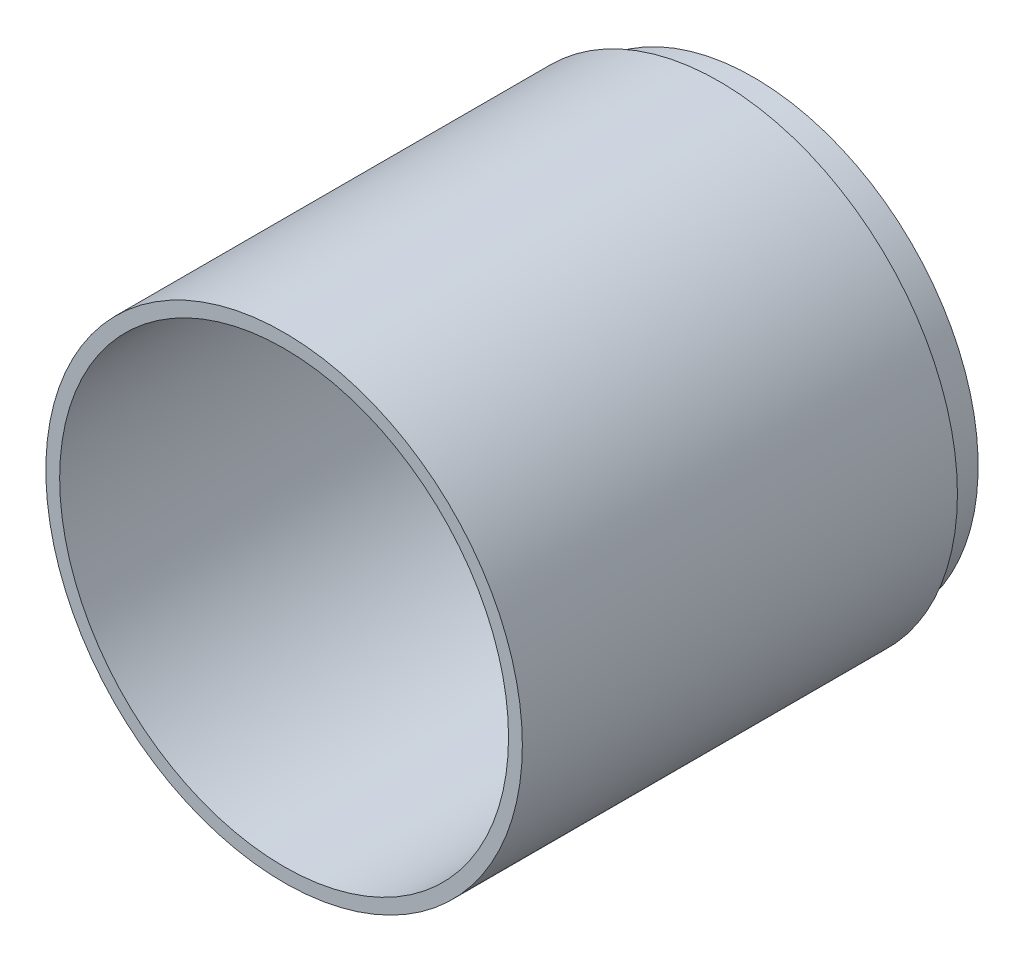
ISO-10303-21;
HEADER;
FILE_DESCRIPTION(('STEP AP214'),'2;1');
FILE_NAME('part.step','',(''),(''),'','','');
FILE_SCHEMA(('AUTOMOTIVE_DESIGN { 1 0 10303 214 1 1 1 1 }'));
ENDSEC;
DATA;
#1=APPLICATION_CONTEXT('core data for automotive mechanical design processes');
#2=APPLICATION_PROTOCOL_DEFINITION('international standard','automotive_design',2000,#1);
#3=PRODUCT_CONTEXT('',#1,'mechanical');
#4=PRODUCT('Part','Part','',(#3));
#5=PRODUCT_RELATED_PRODUCT_CATEGORY('part','',(#4));
#6=PRODUCT_DEFINITION_FORMATION('','',#4);
#7=PRODUCT_DEFINITION_CONTEXT('part definition',#1,'design');
#8=PRODUCT_DEFINITION('design','',#6,#7);
#9=PRODUCT_DEFINITION_SHAPE('','',#8);
#10=(LENGTH_UNIT() NAMED_UNIT(*) SI_UNIT(.MILLI.,.METRE.));
#11=(NAMED_UNIT(*) PLANE_ANGLE_UNIT() SI_UNIT($,.RADIAN.));
#12=(NAMED_UNIT(*) SI_UNIT($,.STERADIAN.) SOLID_ANGLE_UNIT());
#13=UNCERTAINTY_MEASURE_WITH_UNIT(LENGTH_MEASURE(1.E-05),#10,'distance_accuracy_value','');
#14=(GEOMETRIC_REPRESENTATION_CONTEXT(3) GLOBAL_UNCERTAINTY_ASSIGNED_CONTEXT((#13)) GLOBAL_UNIT_ASSIGNED_CONTEXT((#10,
#11,#12)) REPRESENTATION_CONTEXT('',''));
#15=CARTESIAN_POINT('',(0.,0.,0.));
#16=DIRECTION('',(0.,0.,1.));
#17=DIRECTION('',(1.,0.,0.));
#18=AXIS2_PLACEMENT_3D('',#15,#16,#17);
#19=CARTESIAN_POINT('',(0.,0.,63.));
#20=DIRECTION('',(0.,0.,-1.));
#21=DIRECTION('',(-1.,0.,0.));
#22=AXIS2_PLACEMENT_3D('',#19,#20,#21);
#23=CYLINDRICAL_SURFACE('',#22,32.5);
#24=CARTESIAN_POINT('',(0.,0.,63.));
#25=DIRECTION('',(0.,0.,1.));
#26=DIRECTION('',(1.,0.,0.));
#27=AXIS2_PLACEMENT_3D('',#24,#25,#26);
#28=CIRCLE('',#27,32.5);
#29=CARTESIAN_POINT('',(32.5,0.,63.));
#30=VERTEX_POINT('',#29);
#31=EDGE_CURVE('E56',#30,#30,#28,.T.);
#32=ORIENTED_EDGE('',*,*,#31,.T.);
#33=EDGE_LOOP('',(#32));
#34=FACE_BOUND('',#33,.T.);
#35=CARTESIAN_POINT('',(0.,0.,3.));
#36=DIRECTION('',(0.,0.,-1.));
#37=DIRECTION('',(-1.,0.,0.));
#38=AXIS2_PLACEMENT_3D('',#35,#36,#37);
#39=CIRCLE('',#38,32.5);
#40=CARTESIAN_POINT('',(-32.5,0.,3.));
#41=VERTEX_POINT('',#40);
#42=EDGE_CURVE('E65',#41,#41,#39,.T.);
#43=ORIENTED_EDGE('',*,*,#42,.T.);
#44=EDGE_LOOP('',(#43));
#45=FACE_BOUND('',#44,.T.);
#46=ADVANCED_FACE('F43',(#34,#45),#23,.F.);
#47=CARTESIAN_POINT('',(0.,0.,63.));
#48=DIRECTION('',(0.,0.,1.));
#49=DIRECTION('',(1.,0.,0.));
#50=AXIS2_PLACEMENT_3D('',#47,#48,#49);
#51=PLANE('',#50);
#52=CARTESIAN_POINT('',(0.,0.,63.));
#53=DIRECTION('',(0.,0.,1.));
#54=DIRECTION('',(1.,0.,0.));
#55=AXIS2_PLACEMENT_3D('',#52,#53,#54);
#56=CIRCLE('',#55,34.5);
#57=CARTESIAN_POINT('',(34.5,0.,63.));
#58=VERTEX_POINT('',#57);
#59=EDGE_CURVE('E10',#58,#58,#56,.T.);
#60=ORIENTED_EDGE('',*,*,#59,.T.);
#61=EDGE_LOOP('',(#60));
#62=FACE_BOUND('',#61,.T.);
#63=ORIENTED_EDGE('',*,*,#31,.F.);
#64=EDGE_LOOP('',(#63));
#65=FACE_BOUND('',#64,.T.);
#66=ADVANCED_FACE('F95',(#62,#65),#51,.T.);
#67=CARTESIAN_POINT('',(0.,0.,0.));
#68=DIRECTION('',(0.,0.,1.));
#69=DIRECTION('',(1.,0.,0.));
#70=AXIS2_PLACEMENT_3D('',#67,#68,#69);
#71=PLANE('',#70);
#72=CARTESIAN_POINT('',(0.,0.,0.));
#73=DIRECTION('',(0.,0.,1.));
#74=DIRECTION('',(1.,0.,0.));
#75=AXIS2_PLACEMENT_3D('',#72,#73,#74);
#76=CIRCLE('',#75,34.5);
#77=CARTESIAN_POINT('',(34.5,0.,0.));
#78=VERTEX_POINT('',#77);
#79=EDGE_CURVE('E47',#78,#78,#76,.T.);
#80=ORIENTED_EDGE('',*,*,#79,.F.);
#81=EDGE_LOOP('',(#80));
#82=FACE_BOUND('',#81,.T.);
#83=CARTESIAN_POINT('',(0.,0.,0.));
#84=DIRECTION('',(0.,0.,1.));
#85=DIRECTION('',(1.,0.,0.));
#86=AXIS2_PLACEMENT_3D('',#83,#84,#85);
#87=CIRCLE('',#86,32.5);
#88=CARTESIAN_POINT('',(32.5,0.,0.));
#89=VERTEX_POINT('',#88);
#90=EDGE_CURVE('E61',#89,#89,#87,.T.);
#91=ORIENTED_EDGE('',*,*,#90,.T.);
#92=EDGE_LOOP('',(#91));
#93=FACE_BOUND('',#92,.T.);
#94=ADVANCED_FACE('F101',(#82,#93),#71,.F.);
#95=CARTESIAN_POINT('',(0.,0.,63.));
#96=DIRECTION('',(0.,0.,-1.));
#97=DIRECTION('',(-1.,0.,0.));
#98=AXIS2_PLACEMENT_3D('',#95,#96,#97);
#99=CYLINDRICAL_SURFACE('',#98,34.5);
#100=ORIENTED_EDGE('',*,*,#59,.F.);
#101=EDGE_LOOP('',(#100));
#102=FACE_BOUND('',#101,.T.);
#103=ORIENTED_EDGE('',*,*,#79,.T.);
#104=EDGE_LOOP('',(#103));
#105=FACE_BOUND('',#104,.T.);
#106=ADVANCED_FACE('F45',(#102,#105),#99,.T.);
#107=CARTESIAN_POINT('',(0.,0.,3.));
#108=DIRECTION('',(0.,0.,-1.));
#109=DIRECTION('',(-1.,0.,0.));
#110=AXIS2_PLACEMENT_3D('',#107,#108,#109);
#111=CYLINDRICAL_SURFACE('',#110,32.5);
#112=CARTESIAN_POINT('',(0.,0.,-5.));
#113=DIRECTION('',(0.,0.,-1.));
#114=DIRECTION('',(-1.,0.,0.));
#115=AXIS2_PLACEMENT_3D('',#112,#113,#114);
#116=CIRCLE('',#115,32.5);
#117=CARTESIAN_POINT('',(-32.5,0.,-5.));
#118=VERTEX_POINT('',#117);
#119=EDGE_CURVE('E73',#118,#118,#116,.T.);
#120=ORIENTED_EDGE('',*,*,#119,.F.);
#121=EDGE_LOOP('',(#120));
#122=FACE_BOUND('',#121,.T.);
#123=ORIENTED_EDGE('',*,*,#90,.F.);
#124=EDGE_LOOP('',(#123));
#125=FACE_BOUND('',#124,.T.);
#126=ADVANCED_FACE('F105',(#122,#125),#111,.T.);
#127=CARTESIAN_POINT('',(0.,0.,3.));
#128=DIRECTION('',(0.,0.,-1.));
#129=DIRECTION('',(-1.,0.,0.));
#130=AXIS2_PLACEMENT_3D('',#127,#128,#129);
#131=PLANE('',#130);
#132=CARTESIAN_POINT('',(0.,0.,3.));
#133=DIRECTION('',(0.,0.,-1.));
#134=DIRECTION('',(-1.,0.,0.));
#135=AXIS2_PLACEMENT_3D('',#132,#133,#134);
#136=CIRCLE('',#135,30.5);
#137=CARTESIAN_POINT('',(-30.5,0.,3.));
#138=VERTEX_POINT('',#137);
#139=EDGE_CURVE('E69',#138,#138,#136,.T.);
#140=ORIENTED_EDGE('',*,*,#139,.T.);
#141=EDGE_LOOP('',(#140));
#142=FACE_BOUND('',#141,.T.);
#143=ORIENTED_EDGE('',*,*,#42,.F.);
#144=EDGE_LOOP('',(#143));
#145=FACE_BOUND('',#144,.T.);
#146=ADVANCED_FACE('F91',(#142,#145),#131,.F.);
#147=CARTESIAN_POINT('',(0.,0.,3.));
#148=DIRECTION('',(0.,0.,-1.));
#149=DIRECTION('',(-1.,0.,0.));
#150=AXIS2_PLACEMENT_3D('',#147,#148,#149);
#151=CYLINDRICAL_SURFACE('',#150,30.5);
#152=ORIENTED_EDGE('',*,*,#139,.F.);
#153=EDGE_LOOP('',(#152));
#154=FACE_BOUND('',#153,.T.);
#155=CARTESIAN_POINT('',(0.,0.,-5.));
#156=DIRECTION('',(0.,0.,-1.));
#157=DIRECTION('',(-1.,0.,0.));
#158=AXIS2_PLACEMENT_3D('',#155,#156,#157);
#159=CIRCLE('',#158,30.5);
#160=CARTESIAN_POINT('',(-30.5,0.,-5.));
#161=VERTEX_POINT('',#160);
#162=EDGE_CURVE('E77',#161,#161,#159,.T.);
#163=ORIENTED_EDGE('',*,*,#162,.T.);
#164=EDGE_LOOP('',(#163));
#165=FACE_BOUND('',#164,.T.);
#166=ADVANCED_FACE('F82',(#154,#165),#151,.F.);
#167=CARTESIAN_POINT('',(0.,0.,-5.));
#168=DIRECTION('',(0.,0.,-1.));
#169=DIRECTION('',(-1.,0.,0.));
#170=AXIS2_PLACEMENT_3D('',#167,#168,#169);
#171=PLANE('',#170);
#172=ORIENTED_EDGE('',*,*,#119,.T.);
#173=EDGE_LOOP('',(#172));
#174=FACE_BOUND('',#173,.T.);
#175=ORIENTED_EDGE('',*,*,#162,.F.);
#176=EDGE_LOOP('',(#175));
#177=FACE_BOUND('',#176,.T.);
#178=ADVANCED_FACE('F84',(#174,#177),#171,.T.);
#179=CLOSED_SHELL('',(#46,#66,#94,#106,#126,#146,#166,#178));
#180=MANIFOLD_SOLID_BREP('B2',#179);
#181=ADVANCED_BREP_SHAPE_REPRESENTATION('',(#18,#180),#14);
#182=SHAPE_DEFINITION_REPRESENTATION(#9,#181);
ENDSEC;
END-ISO-10303-21;
